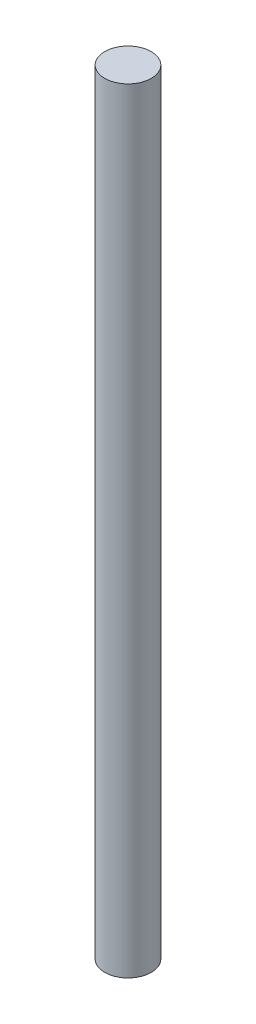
from build123d import *

# Parameters (mm, degrees)
CROQUIS1_R              = 6
SALIENTE_EXTRUIR1_DEPTH = 200


with BuildPart() as part:
    # Croquis1 → Saliente-Extruir1 (new body)
    with BuildSketch(Plane(origin=(0, 0, 0), x_dir=(1, 0, 0), z_dir=(0, 1, 0))):
        with Locations(Location((0, 0, 0), (0, 0, 270))):
            Circle(CROQUIS1_R)
    extrude(amount=SALIENTE_EXTRUIR1_DEPTH)


solid = part.part
